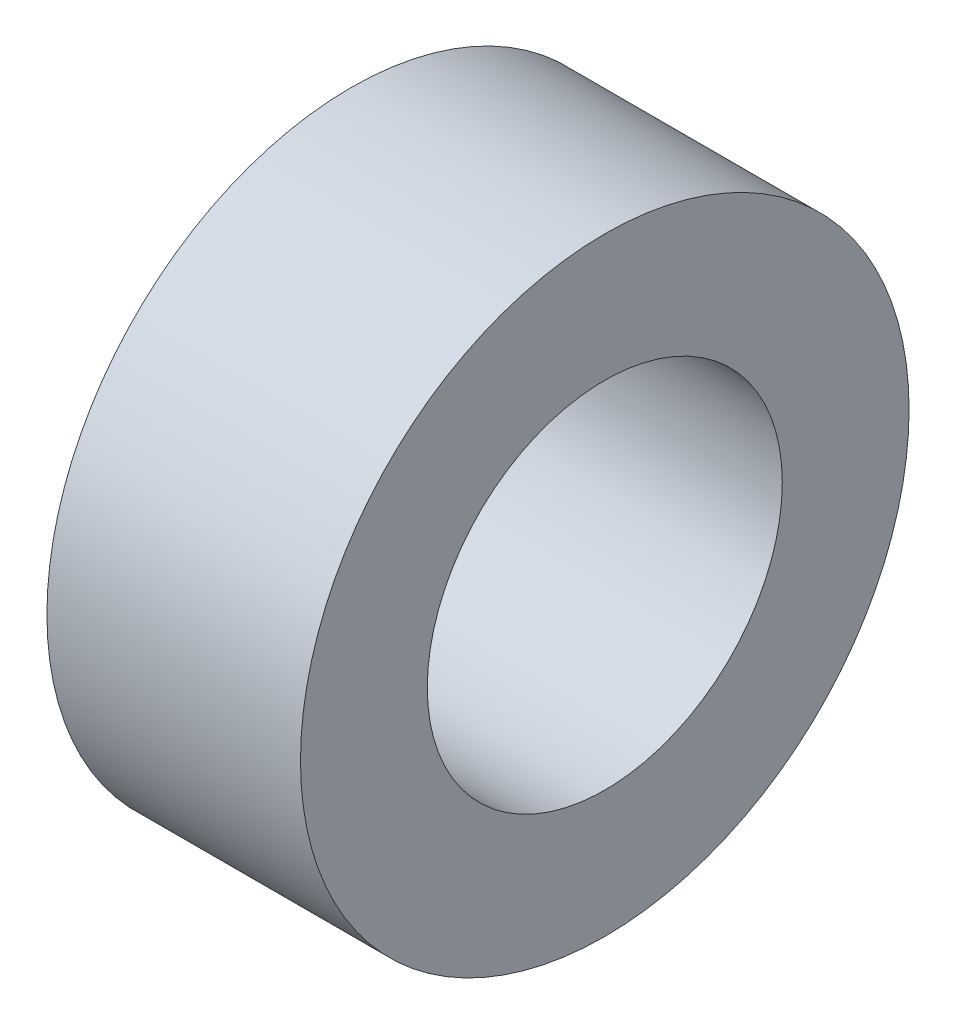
from build123d import *

# Parameters (mm, degrees)
ESQUISSE1_W = 5
ESQUISSE1_H = 2.5


with BuildPart() as part:
    # Esquisse1 → R_volution1 (revolve)
    with BuildSketch(Plane.XY, mode=Mode.PRIVATE) as r_volution1_sk:
        with Locations((13.389028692, 3.201042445)):
            Rectangle(ESQUISSE1_W, ESQUISSE1_H)
    revolve(r_volution1_sk.sketch.rotate(Axis((8.431848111, -1.548957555, 0), (1, 0, 0)), 90), axis=Axis((8.431848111, -1.548957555, 0), (1, 0, 0)))


solid = part.part
